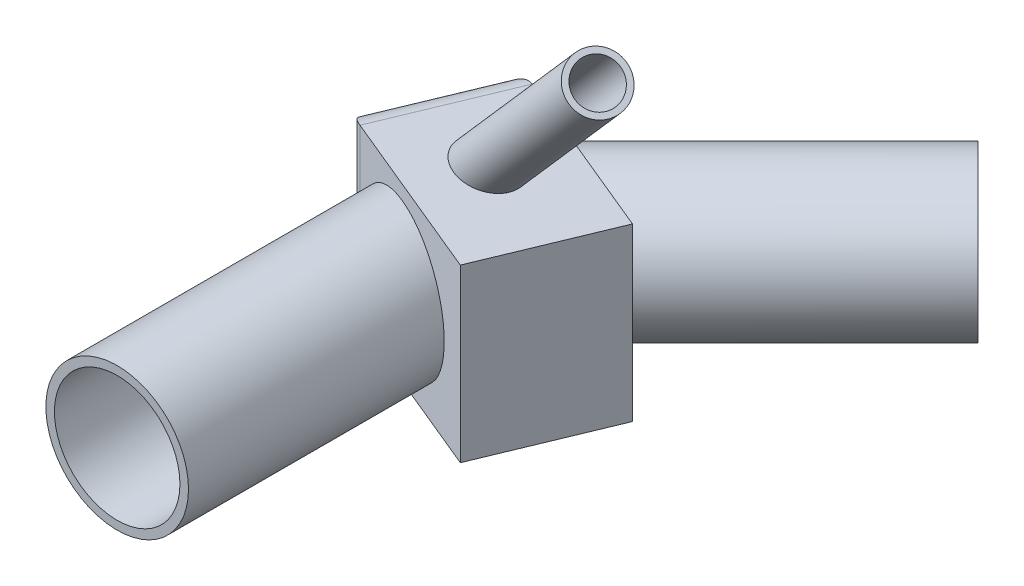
from build123d import *

# Parameters (mm, degrees)
SKETCH2_R           = 6.35
SKETCH2_R_2         = 5.588
EXTRUDE1_DEPTH      = 7.62
EXTRUDE1_DEPTH_BACK = 7.62
FILLET2_R           = 2.54


with BuildPart() as part:
    # Sweep1: sweep along a path in Sketch1
    with BuildLine(Plane(origin=(0, 0, 0), x_dir=(1, 0, 0), z_dir=(0, 1, 0))) as sweep1_path:
        Line((0, 0), (0, 31.75))
        Line((0, 31.75), (22.450640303, 54.200640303))
    # Sketch2 → Sweep1 (sweep)
    with BuildSketch(Plane.XY):
        Circle(SKETCH2_R)
        Circle(SKETCH2_R_2, mode=Mode.SUBTRACT)
    sweep(path=sweep1_path.line, transition=Transition.RIGHT)

    # Sketch3 → Extrude1 (add, two sides: drawn at the far end of the back side and taken through both)
    with BuildSketch(Plane(origin=(0, 0, 0), x_dir=(1, 0, 0), z_dir=(0, 1, 0)).offset(-EXTRUDE1_DEPTH_BACK)):
        Polygon((8.799952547, 21.754940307), (-8.799952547, 29.045059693), (-4.309824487, 39.885187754), (13.290080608, 32.595068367), align=None)
    extrude(amount=EXTRUDE1_DEPTH + EXTRUDE1_DEPTH_BACK)

    # Sketch4 → Revolve1 (revolve)
    with BuildSketch(Plane(origin=(11.225126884, 0, -27.099853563), x_dir=(0.9238795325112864, 0, 0.3826834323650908), z_dir=(-0.3826834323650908, 0, 0.9238795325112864)), mode=Mode.PRIVATE) as revolve1_sk:
        Polygon((6.911275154, 26.909590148), (6.556555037, 27.264310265), (-13.087755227, 7.62), (-12.378314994, 7.62), align=None)
    revolve(revolve1_sk.sketch.rotate(Axis((2.244870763, 7.62, -30.819597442), (0.6532814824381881, 0.7071067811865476, 0.27059805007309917)), 196.324949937), axis=Axis((2.244870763, 7.62, -30.819597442), (0.6532814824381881, 0.7071067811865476, 0.27059805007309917)))

    # Fillet2
    fillet2_edges = [part.edges().sort_by_distance(p)[0] for p in [
        (-4.309824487, 0, -39.885187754),
        (-6.554888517, -7.62, -34.465123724),
        (-8.799952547, 0, -29.045059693),
        (-6.554888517, 7.62, -34.465123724),
    ]]
    fillet(fillet2_edges, radius=FILLET2_R)


solid = part.part
